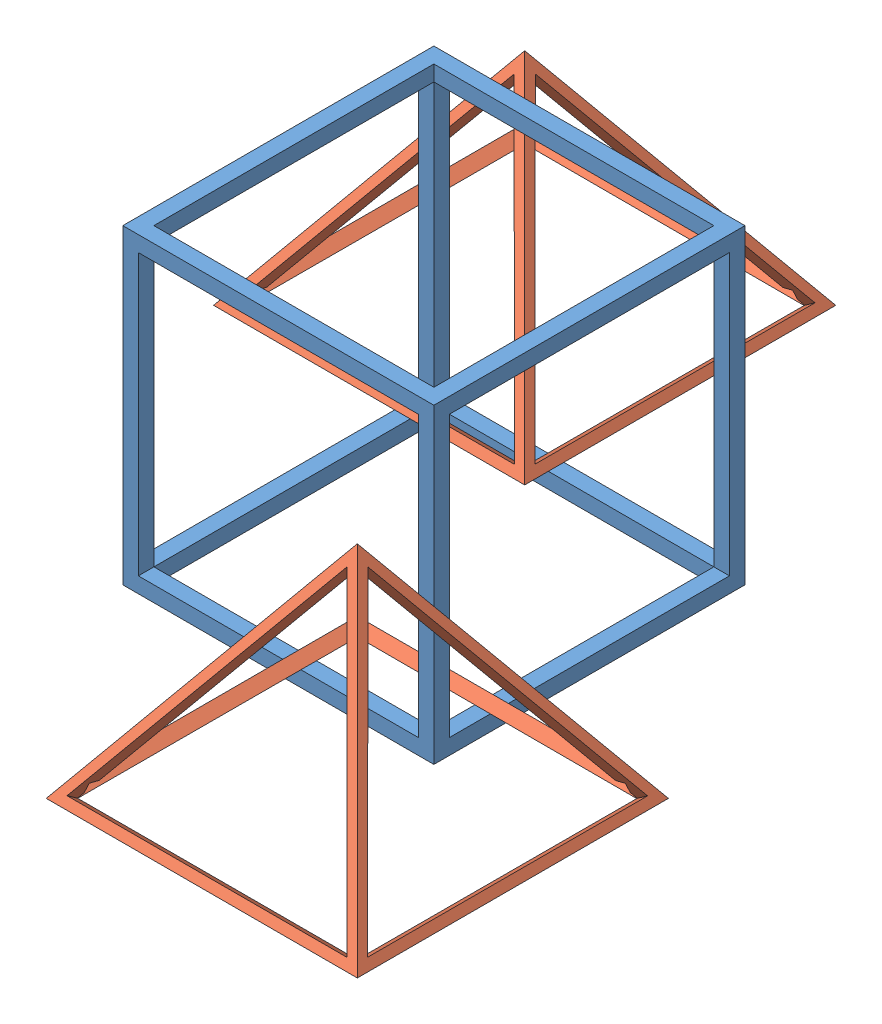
SolidWorks assembly Assem1.sldasm, configuration Default (file format 9000). Lengths in mm.
Overall size (84.15 40 105.67).
3 component instances, 2 part files, 0 mates.
Components (placement in the parent):
- square-1: square.SLDPRT [Default] at (-15.1414 2.7883 54.718) size (40 40 40)
- triangle-1: triangle.SLDPRT [Default] at (-36.8925 6.3224 21.292) size (40 28.35 40)
- triangle-2: triangle.SLDPRT [Default] at (7.2609 6.3339 86.9635) size (40 28.35 40)
